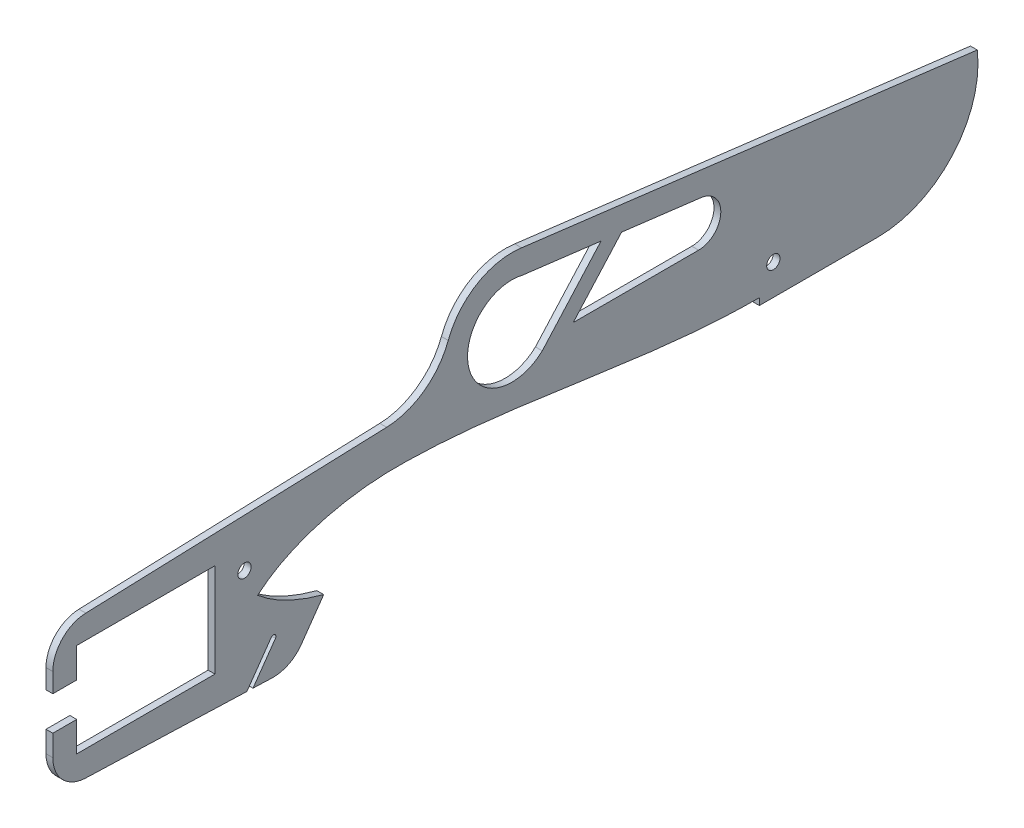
from build123d import *

# Parameters (mm, degrees)
ESQUISSE1_R             = 1.95
EXTRUSION1_DEPTH        = 2
ENL_V_MAT_EXTRU_1_DEPTH = 2


with BuildPart() as part:
    # Esquisse1 → Extrusion1 (new body)
    with BuildSketch(Plane(origin=(0, 0, 0), x_dir=(0, 0, -1), z_dir=(1, 0, 0))):
        with BuildLine():
            Line((-50.347882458, 20.646196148), (37.798125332, 23.714498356))
            ThreePointArc((37.798125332, 23.714498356), (48.800102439, 27.480098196), (55.847563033, 36.729776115))
            ThreePointArc((55.847563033, 36.729776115), (64.337548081, 46.9009527), (77.33180903, 49.485882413))
            Line((77.33180903, 49.485882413), (210.845605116, 32.930615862))
            ThreePointArc((210.845605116, 32.930615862), (203.615560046, 9.894182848), (181.591574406, 0))
            Line((181.591574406, 0), (147, 0))
            Line((147, 0), (147, 2))
            add(Edge.make_bspline(
                [(0, 0), (10.022909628, 8.674688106), (26.503916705, 12.143416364), (52.950245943, 12.25429516), (89.338205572, 8.349824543), (124.878889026, 2.011670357), (147, 2)],
                knots=[0, 0, 0, 0, 0.28007959, 0.28007959, 0.548831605, 1, 1, 1, 1], degree=3))
            add(Edge.make_bspline(
                [(0, 0), (5.168651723, -4.473395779), (12.054703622, -7.562372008), (19.36318086, -9.5129247)],
                knots=[0, 0, 0, 0, 0.144432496, 0.144432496, 0.144432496, 0.144432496], degree=3))
            Line((19.36318086, -9.5129247), (12.796601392, -18.859135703))
            ThreePointArc((12.796601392, -18.859135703), (9.069582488, -22.06294258), (4.266378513, -23.104230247))
            Line((4.266378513, -23.104230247), (-50.347882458, -21.203145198))
            ThreePointArc((-50.347882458, -21.203145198), (-57.193011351, -18.156182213), (-60, -11.20919814))
            Line((-60, -11.20919814), (-60, -5))
            Line((-60, -5), (-53, -5))
            Line((-53, -5), (-53, -13.75))
            Line((-53, -13.75), (-12.5, -13.75))
            Line((-12.5, -13.75), (-12.5, 13.75))
            Line((-12.5, 13.75), (-53, 13.75))
            Line((-53, 13.75), (-53, 5))
            Line((-53, 5), (-60, 5))
            Line((-60, 5), (-60, 10.65224909))
            ThreePointArc((-60, 10.65224909), (-57.193011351, 17.599233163), (-50.347882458, 20.646196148))
        make_face()
        with Locations((-3.855193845, 8.187707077)):
            Circle(ESQUISSE1_R, mode=Mode.SUBTRACT)
        with Locations((151.089942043, 9)):
            Circle(ESQUISSE1_R, mode=Mode.SUBTRACT)
        with BuildLine():
            Line((83.392047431, 20.315075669), (100.59021528, 39.557820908))
            Line((100.59021528, 39.557820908), (77.670034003, 42.399847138))
            ThreePointArc((77.670034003, 42.399847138), (61.910470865, 26.53299895), (83.392047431, 20.315075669))
        make_face(mode=Mode.SUBTRACT)
        with BuildLine():
            Line((106.62713402, 38.809263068), (92.460492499, 22.95844244))
            Line((92.460492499, 22.95844244), (129.203396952, 22.95844244))
            ThreePointArc((129.203396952, 22.95844244), (135.69186057, 29.058530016), (130.003351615, 35.910689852))
            Line((130.003351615, 35.910689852), (106.62713402, 38.809263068))
        make_face(mode=Mode.SUBTRACT)
    extrude(amount=EXTRUSION1_DEPTH)

    # Esquisse2 → Enl_v. mat.-Extru.1 (cut)
    with BuildSketch(Plane.ZY):
        with BuildLine():
            Line((-4.000585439, -12.679119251), (3.326318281, -23.107499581))
            Line((3.326318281, -23.107499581), (2.098967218, -23.969827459))
            Line((2.098967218, -23.969827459), (-5.227936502, -13.541447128))
            ThreePointArc((-5.227936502, -13.541447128), (-5.045424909, -12.496607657), (-4.000585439, -12.679119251))
        make_face()
    extrude(amount=-ENL_V_MAT_EXTRU_1_DEPTH, mode=Mode.SUBTRACT)


solid = part.part
